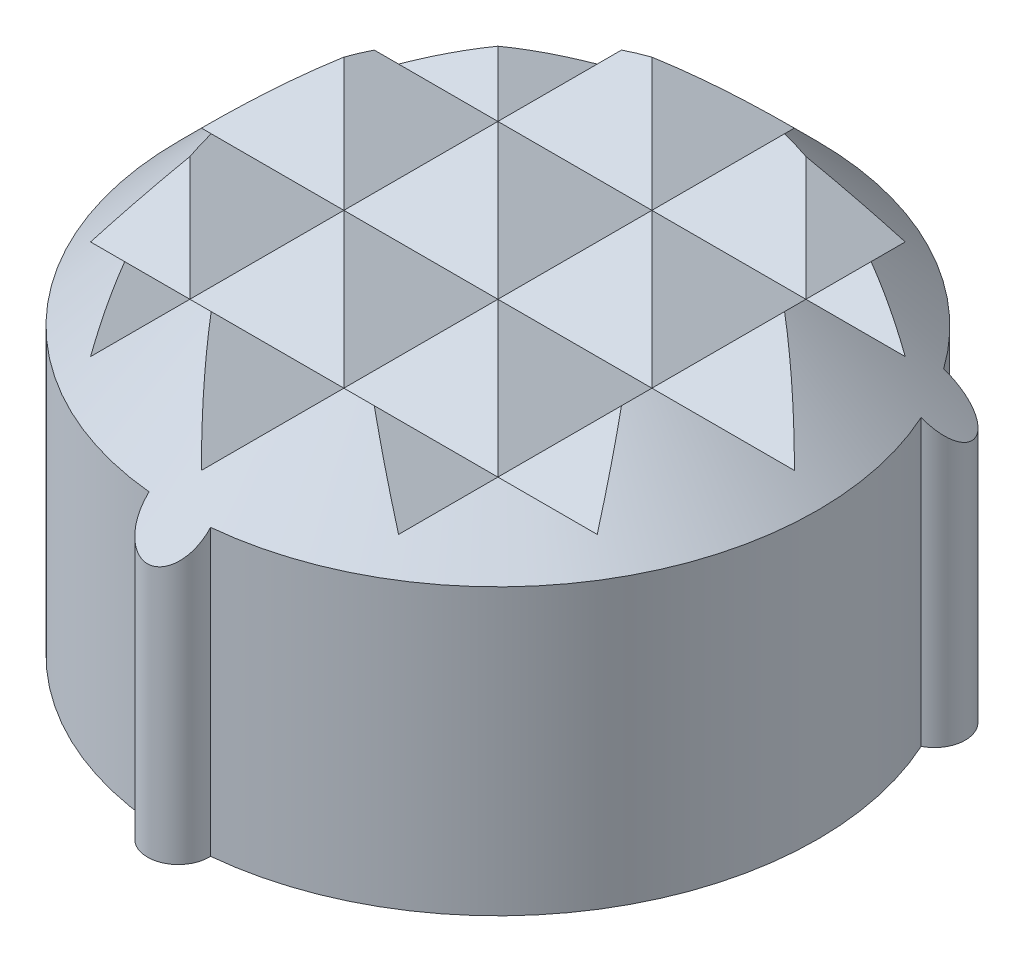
from build123d import *

# Parameters (mm, degrees)
SKETCH1_W             = 4.55
SKETCH1_H             = 5
SKETCH2_R             = 5.05
EXTRUDE1_DEPTH        = 9.14892631
EXTRUDE2_DEPTH        = 8.932528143
LPATTERN1_COUNT       = 8
LPATTERN1_PITCH       = 2
LPATTERN1_COUNT_DIR2  = 8
LPATTERN1_PITCH_DIR2  = 2
MIRROR1_COPY_1_DEPTH  = 8.932528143
MIRROR1_COPY_2_DEPTH  = 8.932528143
MIRROR1_COPY_3_DEPTH  = 8.932528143
MIRROR1_COPY_4_DEPTH  = 8.932528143
MIRROR1_COPY_5_DEPTH  = 8.932528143
MIRROR1_COPY_6_DEPTH  = 8.932528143
MIRROR1_COPY_7_DEPTH  = 8.932528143
MIRROR1_COPY_8_DEPTH  = 8.932528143
MIRROR1_COPY_9_DEPTH  = 8.932528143
MIRROR1_COPY_10_DEPTH = 8.932528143
MIRROR1_COPY_11_DEPTH = 8.932528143
MIRROR1_COPY_12_DEPTH = 8.932528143
MIRROR1_COPY_13_DEPTH = 8.932528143
MIRROR1_COPY_14_DEPTH = 8.932528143
MIRROR1_COPY_15_DEPTH = 8.932528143
MIRROR1_COPY_16_DEPTH = 8.932528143
MIRROR1_COPY_17_DEPTH = 8.932528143
MIRROR1_COPY_18_DEPTH = 8.932528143
MIRROR1_COPY_19_DEPTH = 8.932528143
MIRROR1_COPY_20_DEPTH = 8.932528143
MIRROR1_COPY_21_DEPTH = 8.932528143
MIRROR1_COPY_22_DEPTH = 8.932528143
MIRROR1_COPY_23_DEPTH = 8.932528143
MIRROR1_COPY_24_DEPTH = 8.932528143
MIRROR1_COPY_25_DEPTH = 8.932528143
MIRROR1_COPY_26_DEPTH = 8.932528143
MIRROR1_COPY_27_DEPTH = 8.932528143
MIRROR1_COPY_28_DEPTH = 8.932528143
MIRROR1_COPY_29_DEPTH = 8.932528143
MIRROR1_COPY_30_DEPTH = 8.932528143
MIRROR1_COPY_31_DEPTH = 8.932528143
MIRROR1_COPY_32_DEPTH = 8.932528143
MIRROR1_COPY_33_DEPTH = 8.932528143
MIRROR1_COPY_34_DEPTH = 8.932528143
MIRROR1_COPY_35_DEPTH = 8.932528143
MIRROR1_COPY_36_DEPTH = 8.932528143
MIRROR1_COPY_37_DEPTH = 8.932528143
MIRROR1_COPY_38_DEPTH = 8.932528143
MIRROR1_COPY_39_DEPTH = 8.932528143
MIRROR1_COPY_40_DEPTH = 8.932528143
MIRROR1_COPY_41_DEPTH = 8.932528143
MIRROR1_COPY_42_DEPTH = 8.932528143
MIRROR1_COPY_43_DEPTH = 8.932528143
MIRROR1_COPY_44_DEPTH = 8.932528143
MIRROR1_COPY_45_DEPTH = 8.932528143
MIRROR1_COPY_46_DEPTH = 8.932528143
MIRROR1_COPY_47_DEPTH = 8.932528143
MIRROR1_COPY_48_DEPTH = 8.932528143
MIRROR1_COPY_49_DEPTH = 8.932528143
MIRROR1_COPY_50_DEPTH = 8.932528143
MIRROR1_COPY_51_DEPTH = 8.932528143
MIRROR1_COPY_52_DEPTH = 8.932528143
MIRROR1_COPY_53_DEPTH = 8.932528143
MIRROR1_COPY_54_DEPTH = 8.932528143
MIRROR1_COPY_55_DEPTH = 8.932528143
MIRROR1_COPY_56_DEPTH = 8.932528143
MIRROR1_COPY_57_DEPTH = 8.932528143
MIRROR1_COPY_58_DEPTH = 8.932528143
MIRROR1_COPY_59_DEPTH = 8.932528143
MIRROR1_COPY_60_DEPTH = 8.932528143
MIRROR1_COPY_61_DEPTH = 8.932528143
MIRROR1_COPY_62_DEPTH = 8.932528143
MIRROR1_COPY_63_DEPTH = 8.932528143


with BuildPart() as part:
    # Sketch1 → Revolve1 (revolve)
    with BuildSketch(Plane.XY, mode=Mode.PRIVATE) as revolve1_sk:
        with Locations((2.275, 2.5)):
            Rectangle(SKETCH1_W, SKETCH1_H)
    revolve(revolve1_sk.sketch.rotate(Axis((0, 0, 0), (0, -1, 0)), 90), axis=Axis((0, 0, 0), (0, -1, 0)))

    # Sketch2 → Extrude1 (cut, through all)
    with BuildSketch(Plane(origin=(0, 0, 0), x_dir=(1, 0, 0), z_dir=(0, 1, 0))):
        Circle(SKETCH2_R)
        with BuildLine():
            ThreePointArc((0.399535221, -4.130722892), (3.594005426, -2.075), (3.777078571, 1.719353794))
            ThreePointArc((3.777078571, 1.719353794), (3.940415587, 2.275), (3.377543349, 2.411369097))
            ThreePointArc((3.377543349, 2.411369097), (0, 4.15), (-3.377543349, 2.411369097))
            ThreePointArc((-3.377543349, 2.411369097), (-3.940415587, 2.275), (-3.777078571, 1.719353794))
            ThreePointArc((-3.777078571, 1.719353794), (-3.594005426, -2.075), (-0.399535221, -4.130722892))
            ThreePointArc((-0.399535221, -4.130722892), (0, -4.55), (0.399535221, -4.130722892))
        make_face(mode=Mode.SUBTRACT)
    extrude(amount=EXTRUDE1_DEPTH, mode=Mode.SUBTRACT)

    # Sketch6 → Cut-Revolve1 (revolve, cut)
    with BuildSketch(Plane(origin=(0, 0, 0), x_dir=(0, 0, -1), z_dir=(1, 0, 0)), mode=Mode.PRIVATE) as cut_revolve1_sk:
        Polygon((-6.85, 1), (-6.85, 5), (-2.85, 5), align=None)
    revolve(cut_revolve1_sk.sketch.rotate(Axis((0, 0, 0), (0, 1, 0)), 180), axis=Axis((0, 0, 0), (0, 1, 0)), mode=Mode.SUBTRACT)

    # Sketch5 → Extrude2 (cut, symmetric)
    with BuildSketch(Plane.XY):
        Polygon((1, 5), (0, 4), (-1, 5), align=None)
    extrude2 = extrude(amount=EXTRUDE2_DEPTH, both=True, mode=Mode.SUBTRACT)

    # LPattern1: Extrude2 8 × 8
    with Locations(*[Vector(-1, 0, 0) * (i * LPATTERN1_PITCH) + Vector(1, 0, 0) * (j * LPATTERN1_PITCH_DIR2) for i in range(LPATTERN1_COUNT) for j in range(LPATTERN1_COUNT_DIR2) if (i, j) != (0, 0)]):
        add(extrude2, mode=Mode.SUBTRACT)

    # Mirror1: Extrude2 across plane
    add(extrude2.mirror(Plane(origin=(0, 0, 0), x_dir=(-0.7071067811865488, 0, 0.7071067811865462), z_dir=(0.7071067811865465, 0, 0.7071067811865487))), mode=Mode.SUBTRACT)

    # Mirror1 copy 1 sketch → Mirror1 copy 1 (cut, symmetric)
    with BuildSketch(Plane(origin=(0, 0, -2), x_dir=(0, 0, -1), z_dir=(-1, 0, 0))):
        Polygon((1, -5), (0, -4), (-1, -5), align=None)
    extrude(amount=MIRROR1_COPY_1_DEPTH, both=True, mode=Mode.SUBTRACT)

    # Mirror1 copy 2 sketch → Mirror1 copy 2 (cut, symmetric)
    with BuildSketch(Plane(origin=(0, 0, -4), x_dir=(0, 0, -1), z_dir=(-1, 0, 0))):
        Polygon((1, -5), (0, -4), (-1, -5), align=None)
    extrude(amount=MIRROR1_COPY_2_DEPTH, both=True, mode=Mode.SUBTRACT)

    # Mirror1 copy 3 sketch → Mirror1 copy 3 (cut, symmetric)
    with BuildSketch(Plane(origin=(0, 0, -6), x_dir=(0, 0, -1), z_dir=(-1, 0, 0))):
        Polygon((1, -5), (0, -4), (-1, -5), align=None)
    extrude(amount=MIRROR1_COPY_3_DEPTH, both=True, mode=Mode.SUBTRACT)

    # Mirror1 copy 4 sketch → Mirror1 copy 4 (cut, symmetric)
    with BuildSketch(Plane(origin=(0, 0, -8), x_dir=(0, 0, -1), z_dir=(-1, 0, 0))):
        Polygon((1, -5), (0, -4), (-1, -5), align=None)
    extrude(amount=MIRROR1_COPY_4_DEPTH, both=True, mode=Mode.SUBTRACT)

    # Mirror1 copy 5 sketch → Mirror1 copy 5 (cut, symmetric)
    with BuildSketch(Plane(origin=(0, 0, -10), x_dir=(0, 0, -1), z_dir=(-1, 0, 0))):
        Polygon((1, -5), (0, -4), (-1, -5), align=None)
    extrude(amount=MIRROR1_COPY_5_DEPTH, both=True, mode=Mode.SUBTRACT)

    # Mirror1 copy 6 sketch → Mirror1 copy 6 (cut, symmetric)
    with BuildSketch(Plane(origin=(0, 0, -12), x_dir=(0, 0, -1), z_dir=(-1, 0, 0))):
        Polygon((1, -5), (0, -4), (-1, -5), align=None)
    extrude(amount=MIRROR1_COPY_6_DEPTH, both=True, mode=Mode.SUBTRACT)

    # Mirror1 copy 7 sketch → Mirror1 copy 7 (cut, symmetric)
    with BuildSketch(Plane(origin=(0, 0, -14), x_dir=(0, 0, -1), z_dir=(-1, 0, 0))):
        Polygon((1, -5), (0, -4), (-1, -5), align=None)
    extrude(amount=MIRROR1_COPY_7_DEPTH, both=True, mode=Mode.SUBTRACT)

    # Mirror1 copy 8 sketch → Mirror1 copy 8 (cut, symmetric)
    with BuildSketch(Plane(origin=(0, 0, 2), x_dir=(0, 0, -1), z_dir=(-1, 0, 0))):
        Polygon((1, -5), (0, -4), (-1, -5), align=None)
    extrude(amount=MIRROR1_COPY_8_DEPTH, both=True, mode=Mode.SUBTRACT)

    # Mirror1 copy 9 sketch → Mirror1 copy 9 (cut, symmetric)
    with BuildSketch(Plane(origin=(0, 0, 0), x_dir=(0, 0, -1), z_dir=(-1, 0, 0))):
        Polygon((1, -5), (0, -4), (-1, -5), align=None)
    extrude(amount=MIRROR1_COPY_9_DEPTH, both=True, mode=Mode.SUBTRACT)

    # Mirror1 copy 10 sketch → Mirror1 copy 10 (cut, symmetric)
    with BuildSketch(Plane(origin=(0, 0, -2), x_dir=(0, 0, -1), z_dir=(-1, 0, 0))):
        Polygon((1, -5), (0, -4), (-1, -5), align=None)
    extrude(amount=MIRROR1_COPY_10_DEPTH, both=True, mode=Mode.SUBTRACT)

    # Mirror1 copy 11 sketch → Mirror1 copy 11 (cut, symmetric)
    with BuildSketch(Plane(origin=(0, 0, -4), x_dir=(0, 0, -1), z_dir=(-1, 0, 0))):
        Polygon((1, -5), (0, -4), (-1, -5), align=None)
    extrude(amount=MIRROR1_COPY_11_DEPTH, both=True, mode=Mode.SUBTRACT)

    # Mirror1 copy 12 sketch → Mirror1 copy 12 (cut, symmetric)
    with BuildSketch(Plane(origin=(0, 0, -6), x_dir=(0, 0, -1), z_dir=(-1, 0, 0))):
        Polygon((1, -5), (0, -4), (-1, -5), align=None)
    extrude(amount=MIRROR1_COPY_12_DEPTH, both=True, mode=Mode.SUBTRACT)

    # Mirror1 copy 13 sketch → Mirror1 copy 13 (cut, symmetric)
    with BuildSketch(Plane(origin=(0, 0, -8), x_dir=(0, 0, -1), z_dir=(-1, 0, 0))):
        Polygon((1, -5), (0, -4), (-1, -5), align=None)
    extrude(amount=MIRROR1_COPY_13_DEPTH, both=True, mode=Mode.SUBTRACT)

    # Mirror1 copy 14 sketch → Mirror1 copy 14 (cut, symmetric)
    with BuildSketch(Plane(origin=(0, 0, -10), x_dir=(0, 0, -1), z_dir=(-1, 0, 0))):
        Polygon((1, -5), (0, -4), (-1, -5), align=None)
    extrude(amount=MIRROR1_COPY_14_DEPTH, both=True, mode=Mode.SUBTRACT)

    # Mirror1 copy 15 sketch → Mirror1 copy 15 (cut, symmetric)
    with BuildSketch(Plane(origin=(0, 0, -12), x_dir=(0, 0, -1), z_dir=(-1, 0, 0))):
        Polygon((1, -5), (0, -4), (-1, -5), align=None)
    extrude(amount=MIRROR1_COPY_15_DEPTH, both=True, mode=Mode.SUBTRACT)

    # Mirror1 copy 16 sketch → Mirror1 copy 16 (cut, symmetric)
    with BuildSketch(Plane(origin=(0, 0, 4), x_dir=(0, 0, -1), z_dir=(-1, 0, 0))):
        Polygon((1, -5), (0, -4), (-1, -5), align=None)
    extrude(amount=MIRROR1_COPY_16_DEPTH, both=True, mode=Mode.SUBTRACT)

    # Mirror1 copy 17 sketch → Mirror1 copy 17 (cut, symmetric)
    with BuildSketch(Plane(origin=(0, 0, 2), x_dir=(0, 0, -1), z_dir=(-1, 0, 0))):
        Polygon((1, -5), (0, -4), (-1, -5), align=None)
    extrude(amount=MIRROR1_COPY_17_DEPTH, both=True, mode=Mode.SUBTRACT)

    # Mirror1 copy 18 sketch → Mirror1 copy 18 (cut, symmetric)
    with BuildSketch(Plane(origin=(0, 0, 0), x_dir=(0, 0, -1), z_dir=(-1, 0, 0))):
        Polygon((1, -5), (0, -4), (-1, -5), align=None)
    extrude(amount=MIRROR1_COPY_18_DEPTH, both=True, mode=Mode.SUBTRACT)

    # Mirror1 copy 19 sketch → Mirror1 copy 19 (cut, symmetric)
    with BuildSketch(Plane(origin=(0, 0, -2), x_dir=(0, 0, -1), z_dir=(-1, 0, 0))):
        Polygon((1, -5), (0, -4), (-1, -5), align=None)
    extrude(amount=MIRROR1_COPY_19_DEPTH, both=True, mode=Mode.SUBTRACT)

    # Mirror1 copy 20 sketch → Mirror1 copy 20 (cut, symmetric)
    with BuildSketch(Plane(origin=(0, 0, -4), x_dir=(0, 0, -1), z_dir=(-1, 0, 0))):
        Polygon((1, -5), (0, -4), (-1, -5), align=None)
    extrude(amount=MIRROR1_COPY_20_DEPTH, both=True, mode=Mode.SUBTRACT)

    # Mirror1 copy 21 sketch → Mirror1 copy 21 (cut, symmetric)
    with BuildSketch(Plane(origin=(0, 0, -6), x_dir=(0, 0, -1), z_dir=(-1, 0, 0))):
        Polygon((1, -5), (0, -4), (-1, -5), align=None)
    extrude(amount=MIRROR1_COPY_21_DEPTH, both=True, mode=Mode.SUBTRACT)

    # Mirror1 copy 22 sketch → Mirror1 copy 22 (cut, symmetric)
    with BuildSketch(Plane(origin=(0, 0, -8), x_dir=(0, 0, -1), z_dir=(-1, 0, 0))):
        Polygon((1, -5), (0, -4), (-1, -5), align=None)
    extrude(amount=MIRROR1_COPY_22_DEPTH, both=True, mode=Mode.SUBTRACT)

    # Mirror1 copy 23 sketch → Mirror1 copy 23 (cut, symmetric)
    with BuildSketch(Plane(origin=(0, 0, -10), x_dir=(0, 0, -1), z_dir=(-1, 0, 0))):
        Polygon((1, -5), (0, -4), (-1, -5), align=None)
    extrude(amount=MIRROR1_COPY_23_DEPTH, both=True, mode=Mode.SUBTRACT)

    # Mirror1 copy 24 sketch → Mirror1 copy 24 (cut, symmetric)
    with BuildSketch(Plane(origin=(0, 0, 6), x_dir=(0, 0, -1), z_dir=(-1, 0, 0))):
        Polygon((1, -5), (0, -4), (-1, -5), align=None)
    extrude(amount=MIRROR1_COPY_24_DEPTH, both=True, mode=Mode.SUBTRACT)

    # Mirror1 copy 25 sketch → Mirror1 copy 25 (cut, symmetric)
    with BuildSketch(Plane(origin=(0, 0, 4), x_dir=(0, 0, -1), z_dir=(-1, 0, 0))):
        Polygon((1, -5), (0, -4), (-1, -5), align=None)
    extrude(amount=MIRROR1_COPY_25_DEPTH, both=True, mode=Mode.SUBTRACT)

    # Mirror1 copy 26 sketch → Mirror1 copy 26 (cut, symmetric)
    with BuildSketch(Plane(origin=(0, 0, 2), x_dir=(0, 0, -1), z_dir=(-1, 0, 0))):
        Polygon((1, -5), (0, -4), (-1, -5), align=None)
    extrude(amount=MIRROR1_COPY_26_DEPTH, both=True, mode=Mode.SUBTRACT)

    # Mirror1 copy 27 sketch → Mirror1 copy 27 (cut, symmetric)
    with BuildSketch(Plane(origin=(0, 0, 0), x_dir=(0, 0, -1), z_dir=(-1, 0, 0))):
        Polygon((1, -5), (0, -4), (-1, -5), align=None)
    extrude(amount=MIRROR1_COPY_27_DEPTH, both=True, mode=Mode.SUBTRACT)

    # Mirror1 copy 28 sketch → Mirror1 copy 28 (cut, symmetric)
    with BuildSketch(Plane(origin=(0, 0, -2), x_dir=(0, 0, -1), z_dir=(-1, 0, 0))):
        Polygon((1, -5), (0, -4), (-1, -5), align=None)
    extrude(amount=MIRROR1_COPY_28_DEPTH, both=True, mode=Mode.SUBTRACT)

    # Mirror1 copy 29 sketch → Mirror1 copy 29 (cut, symmetric)
    with BuildSketch(Plane(origin=(0, 0, -4), x_dir=(0, 0, -1), z_dir=(-1, 0, 0))):
        Polygon((1, -5), (0, -4), (-1, -5), align=None)
    extrude(amount=MIRROR1_COPY_29_DEPTH, both=True, mode=Mode.SUBTRACT)

    # Mirror1 copy 30 sketch → Mirror1 copy 30 (cut, symmetric)
    with BuildSketch(Plane(origin=(0, 0, -6), x_dir=(0, 0, -1), z_dir=(-1, 0, 0))):
        Polygon((1, -5), (0, -4), (-1, -5), align=None)
    extrude(amount=MIRROR1_COPY_30_DEPTH, both=True, mode=Mode.SUBTRACT)

    # Mirror1 copy 31 sketch → Mirror1 copy 31 (cut, symmetric)
    with BuildSketch(Plane(origin=(0, 0, -8), x_dir=(0, 0, -1), z_dir=(-1, 0, 0))):
        Polygon((1, -5), (0, -4), (-1, -5), align=None)
    extrude(amount=MIRROR1_COPY_31_DEPTH, both=True, mode=Mode.SUBTRACT)

    # Mirror1 copy 32 sketch → Mirror1 copy 32 (cut, symmetric)
    with BuildSketch(Plane(origin=(0, 0, 8), x_dir=(0, 0, -1), z_dir=(-1, 0, 0))):
        Polygon((1, -5), (0, -4), (-1, -5), align=None)
    extrude(amount=MIRROR1_COPY_32_DEPTH, both=True, mode=Mode.SUBTRACT)

    # Mirror1 copy 33 sketch → Mirror1 copy 33 (cut, symmetric)
    with BuildSketch(Plane(origin=(0, 0, 6), x_dir=(0, 0, -1), z_dir=(-1, 0, 0))):
        Polygon((1, -5), (0, -4), (-1, -5), align=None)
    extrude(amount=MIRROR1_COPY_33_DEPTH, both=True, mode=Mode.SUBTRACT)

    # Mirror1 copy 34 sketch → Mirror1 copy 34 (cut, symmetric)
    with BuildSketch(Plane(origin=(0, 0, 4), x_dir=(0, 0, -1), z_dir=(-1, 0, 0))):
        Polygon((1, -5), (0, -4), (-1, -5), align=None)
    extrude(amount=MIRROR1_COPY_34_DEPTH, both=True, mode=Mode.SUBTRACT)

    # Mirror1 copy 35 sketch → Mirror1 copy 35 (cut, symmetric)
    with BuildSketch(Plane(origin=(0, 0, 2), x_dir=(0, 0, -1), z_dir=(-1, 0, 0))):
        Polygon((1, -5), (0, -4), (-1, -5), align=None)
    extrude(amount=MIRROR1_COPY_35_DEPTH, both=True, mode=Mode.SUBTRACT)

    # Mirror1 copy 36 sketch → Mirror1 copy 36 (cut, symmetric)
    with BuildSketch(Plane(origin=(0, 0, 0), x_dir=(0, 0, -1), z_dir=(-1, 0, 0))):
        Polygon((1, -5), (0, -4), (-1, -5), align=None)
    extrude(amount=MIRROR1_COPY_36_DEPTH, both=True, mode=Mode.SUBTRACT)

    # Mirror1 copy 37 sketch → Mirror1 copy 37 (cut, symmetric)
    with BuildSketch(Plane(origin=(0, 0, -2), x_dir=(0, 0, -1), z_dir=(-1, 0, 0))):
        Polygon((1, -5), (0, -4), (-1, -5), align=None)
    extrude(amount=MIRROR1_COPY_37_DEPTH, both=True, mode=Mode.SUBTRACT)

    # Mirror1 copy 38 sketch → Mirror1 copy 38 (cut, symmetric)
    with BuildSketch(Plane(origin=(0, 0, -4), x_dir=(0, 0, -1), z_dir=(-1, 0, 0))):
        Polygon((1, -5), (0, -4), (-1, -5), align=None)
    extrude(amount=MIRROR1_COPY_38_DEPTH, both=True, mode=Mode.SUBTRACT)

    # Mirror1 copy 39 sketch → Mirror1 copy 39 (cut, symmetric)
    with BuildSketch(Plane(origin=(0, 0, -6), x_dir=(0, 0, -1), z_dir=(-1, 0, 0))):
        Polygon((1, -5), (0, -4), (-1, -5), align=None)
    extrude(amount=MIRROR1_COPY_39_DEPTH, both=True, mode=Mode.SUBTRACT)

    # Mirror1 copy 40 sketch → Mirror1 copy 40 (cut, symmetric)
    with BuildSketch(Plane(origin=(0, 0, 10), x_dir=(0, 0, -1), z_dir=(-1, 0, 0))):
        Polygon((1, -5), (0, -4), (-1, -5), align=None)
    extrude(amount=MIRROR1_COPY_40_DEPTH, both=True, mode=Mode.SUBTRACT)

    # Mirror1 copy 41 sketch → Mirror1 copy 41 (cut, symmetric)
    with BuildSketch(Plane(origin=(0, 0, 8), x_dir=(0, 0, -1), z_dir=(-1, 0, 0))):
        Polygon((1, -5), (0, -4), (-1, -5), align=None)
    extrude(amount=MIRROR1_COPY_41_DEPTH, both=True, mode=Mode.SUBTRACT)

    # Mirror1 copy 42 sketch → Mirror1 copy 42 (cut, symmetric)
    with BuildSketch(Plane(origin=(0, 0, 6), x_dir=(0, 0, -1), z_dir=(-1, 0, 0))):
        Polygon((1, -5), (0, -4), (-1, -5), align=None)
    extrude(amount=MIRROR1_COPY_42_DEPTH, both=True, mode=Mode.SUBTRACT)

    # Mirror1 copy 43 sketch → Mirror1 copy 43 (cut, symmetric)
    with BuildSketch(Plane(origin=(0, 0, 4), x_dir=(0, 0, -1), z_dir=(-1, 0, 0))):
        Polygon((1, -5), (0, -4), (-1, -5), align=None)
    extrude(amount=MIRROR1_COPY_43_DEPTH, both=True, mode=Mode.SUBTRACT)

    # Mirror1 copy 44 sketch → Mirror1 copy 44 (cut, symmetric)
    with BuildSketch(Plane(origin=(0, 0, 2), x_dir=(0, 0, -1), z_dir=(-1, 0, 0))):
        Polygon((1, -5), (0, -4), (-1, -5), align=None)
    extrude(amount=MIRROR1_COPY_44_DEPTH, both=True, mode=Mode.SUBTRACT)

    # Mirror1 copy 45 sketch → Mirror1 copy 45 (cut, symmetric)
    with BuildSketch(Plane(origin=(0, 0, 0), x_dir=(0, 0, -1), z_dir=(-1, 0, 0))):
        Polygon((1, -5), (0, -4), (-1, -5), align=None)
    extrude(amount=MIRROR1_COPY_45_DEPTH, both=True, mode=Mode.SUBTRACT)

    # Mirror1 copy 46 sketch → Mirror1 copy 46 (cut, symmetric)
    with BuildSketch(Plane(origin=(0, 0, -2), x_dir=(0, 0, -1), z_dir=(-1, 0, 0))):
        Polygon((1, -5), (0, -4), (-1, -5), align=None)
    extrude(amount=MIRROR1_COPY_46_DEPTH, both=True, mode=Mode.SUBTRACT)

    # Mirror1 copy 47 sketch → Mirror1 copy 47 (cut, symmetric)
    with BuildSketch(Plane(origin=(0, 0, -4), x_dir=(0, 0, -1), z_dir=(-1, 0, 0))):
        Polygon((1, -5), (0, -4), (-1, -5), align=None)
    extrude(amount=MIRROR1_COPY_47_DEPTH, both=True, mode=Mode.SUBTRACT)

    # Mirror1 copy 48 sketch → Mirror1 copy 48 (cut, symmetric)
    with BuildSketch(Plane(origin=(0, 0, 12), x_dir=(0, 0, -1), z_dir=(-1, 0, 0))):
        Polygon((1, -5), (0, -4), (-1, -5), align=None)
    extrude(amount=MIRROR1_COPY_48_DEPTH, both=True, mode=Mode.SUBTRACT)

    # Mirror1 copy 49 sketch → Mirror1 copy 49 (cut, symmetric)
    with BuildSketch(Plane(origin=(0, 0, 10), x_dir=(0, 0, -1), z_dir=(-1, 0, 0))):
        Polygon((1, -5), (0, -4), (-1, -5), align=None)
    extrude(amount=MIRROR1_COPY_49_DEPTH, both=True, mode=Mode.SUBTRACT)

    # Mirror1 copy 50 sketch → Mirror1 copy 50 (cut, symmetric)
    with BuildSketch(Plane(origin=(0, 0, 8), x_dir=(0, 0, -1), z_dir=(-1, 0, 0))):
        Polygon((1, -5), (0, -4), (-1, -5), align=None)
    extrude(amount=MIRROR1_COPY_50_DEPTH, both=True, mode=Mode.SUBTRACT)

    # Mirror1 copy 51 sketch → Mirror1 copy 51 (cut, symmetric)
    with BuildSketch(Plane(origin=(0, 0, 6), x_dir=(0, 0, -1), z_dir=(-1, 0, 0))):
        Polygon((1, -5), (0, -4), (-1, -5), align=None)
    extrude(amount=MIRROR1_COPY_51_DEPTH, both=True, mode=Mode.SUBTRACT)

    # Mirror1 copy 52 sketch → Mirror1 copy 52 (cut, symmetric)
    with BuildSketch(Plane(origin=(0, 0, 4), x_dir=(0, 0, -1), z_dir=(-1, 0, 0))):
        Polygon((1, -5), (0, -4), (-1, -5), align=None)
    extrude(amount=MIRROR1_COPY_52_DEPTH, both=True, mode=Mode.SUBTRACT)

    # Mirror1 copy 53 sketch → Mirror1 copy 53 (cut, symmetric)
    with BuildSketch(Plane(origin=(0, 0, 2), x_dir=(0, 0, -1), z_dir=(-1, 0, 0))):
        Polygon((1, -5), (0, -4), (-1, -5), align=None)
    extrude(amount=MIRROR1_COPY_53_DEPTH, both=True, mode=Mode.SUBTRACT)

    # Mirror1 copy 54 sketch → Mirror1 copy 54 (cut, symmetric)
    with BuildSketch(Plane(origin=(0, 0, 0), x_dir=(0, 0, -1), z_dir=(-1, 0, 0))):
        Polygon((1, -5), (0, -4), (-1, -5), align=None)
    extrude(amount=MIRROR1_COPY_54_DEPTH, both=True, mode=Mode.SUBTRACT)

    # Mirror1 copy 55 sketch → Mirror1 copy 55 (cut, symmetric)
    with BuildSketch(Plane(origin=(0, 0, -2), x_dir=(0, 0, -1), z_dir=(-1, 0, 0))):
        Polygon((1, -5), (0, -4), (-1, -5), align=None)
    extrude(amount=MIRROR1_COPY_55_DEPTH, both=True, mode=Mode.SUBTRACT)

    # Mirror1 copy 56 sketch → Mirror1 copy 56 (cut, symmetric)
    with BuildSketch(Plane(origin=(0, 0, 14), x_dir=(0, 0, -1), z_dir=(-1, 0, 0))):
        Polygon((1, -5), (0, -4), (-1, -5), align=None)
    extrude(amount=MIRROR1_COPY_56_DEPTH, both=True, mode=Mode.SUBTRACT)

    # Mirror1 copy 57 sketch → Mirror1 copy 57 (cut, symmetric)
    with BuildSketch(Plane(origin=(0, 0, 12), x_dir=(0, 0, -1), z_dir=(-1, 0, 0))):
        Polygon((1, -5), (0, -4), (-1, -5), align=None)
    extrude(amount=MIRROR1_COPY_57_DEPTH, both=True, mode=Mode.SUBTRACT)

    # Mirror1 copy 58 sketch → Mirror1 copy 58 (cut, symmetric)
    with BuildSketch(Plane(origin=(0, 0, 10), x_dir=(0, 0, -1), z_dir=(-1, 0, 0))):
        Polygon((1, -5), (0, -4), (-1, -5), align=None)
    extrude(amount=MIRROR1_COPY_58_DEPTH, both=True, mode=Mode.SUBTRACT)

    # Mirror1 copy 59 sketch → Mirror1 copy 59 (cut, symmetric)
    with BuildSketch(Plane(origin=(0, 0, 8), x_dir=(0, 0, -1), z_dir=(-1, 0, 0))):
        Polygon((1, -5), (0, -4), (-1, -5), align=None)
    extrude(amount=MIRROR1_COPY_59_DEPTH, both=True, mode=Mode.SUBTRACT)

    # Mirror1 copy 60 sketch → Mirror1 copy 60 (cut, symmetric)
    with BuildSketch(Plane(origin=(0, 0, 6), x_dir=(0, 0, -1), z_dir=(-1, 0, 0))):
        Polygon((1, -5), (0, -4), (-1, -5), align=None)
    extrude(amount=MIRROR1_COPY_60_DEPTH, both=True, mode=Mode.SUBTRACT)

    # Mirror1 copy 61 sketch → Mirror1 copy 61 (cut, symmetric)
    with BuildSketch(Plane(origin=(0, 0, 4), x_dir=(0, 0, -1), z_dir=(-1, 0, 0))):
        Polygon((1, -5), (0, -4), (-1, -5), align=None)
    extrude(amount=MIRROR1_COPY_61_DEPTH, both=True, mode=Mode.SUBTRACT)

    # Mirror1 copy 62 sketch → Mirror1 copy 62 (cut, symmetric)
    with BuildSketch(Plane(origin=(0, 0, 2), x_dir=(0, 0, -1), z_dir=(-1, 0, 0))):
        Polygon((1, -5), (0, -4), (-1, -5), align=None)
    extrude(amount=MIRROR1_COPY_62_DEPTH, both=True, mode=Mode.SUBTRACT)

    # Mirror1 copy 63 sketch → Mirror1 copy 63 (cut, symmetric)
    with BuildSketch(Plane(origin=(0, 0, 0), x_dir=(0, 0, -1), z_dir=(-1, 0, 0))):
        Polygon((1, -5), (0, -4), (-1, -5), align=None)
    extrude(amount=MIRROR1_COPY_63_DEPTH, both=True, mode=Mode.SUBTRACT)


solid = part.part
